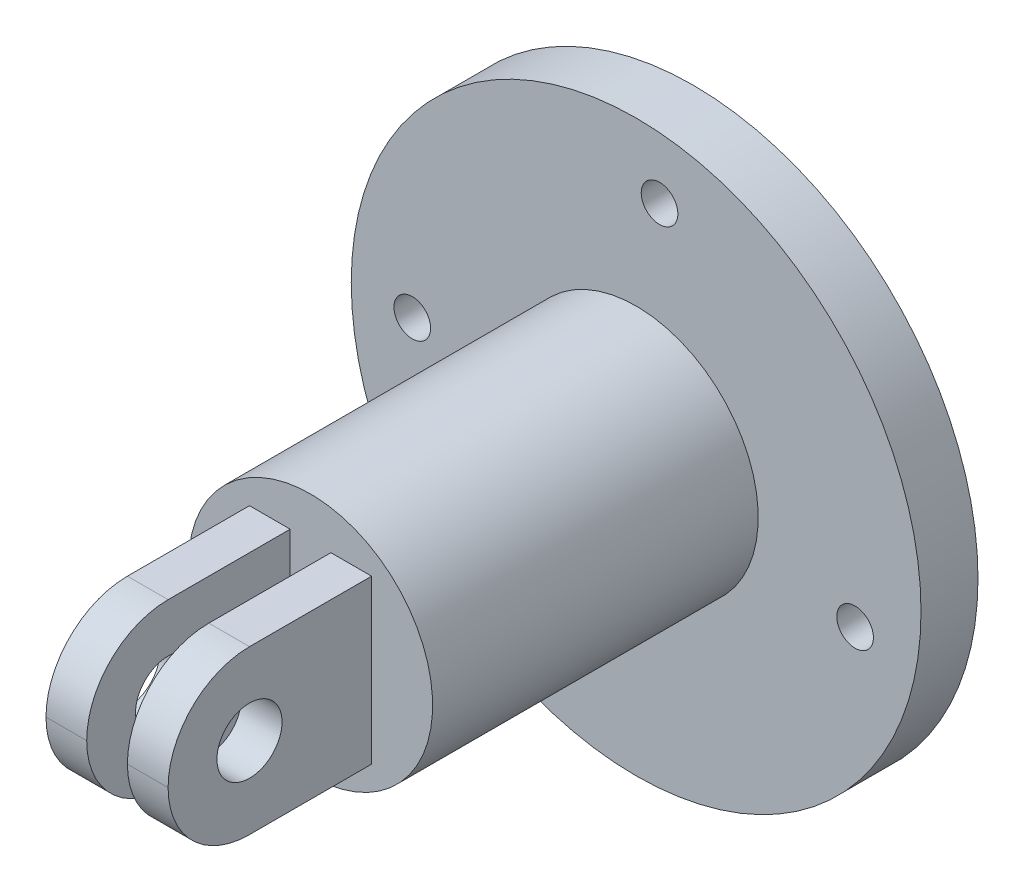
ISO-10303-21;
HEADER;
FILE_DESCRIPTION(('STEP AP214'),'2;1');
FILE_NAME('part.step','',(''),(''),'','','');
FILE_SCHEMA(('AUTOMOTIVE_DESIGN { 1 0 10303 214 1 1 1 1 }'));
ENDSEC;
DATA;
#1=APPLICATION_CONTEXT('core data for automotive mechanical design processes');
#2=APPLICATION_PROTOCOL_DEFINITION('international standard','automotive_design',2000,#1);
#3=PRODUCT_CONTEXT('',#1,'mechanical');
#4=PRODUCT('Part','Part','',(#3));
#5=PRODUCT_RELATED_PRODUCT_CATEGORY('part','',(#4));
#6=PRODUCT_DEFINITION_FORMATION('','',#4);
#7=PRODUCT_DEFINITION_CONTEXT('part definition',#1,'design');
#8=PRODUCT_DEFINITION('design','',#6,#7);
#9=PRODUCT_DEFINITION_SHAPE('','',#8);
#10=(LENGTH_UNIT() NAMED_UNIT(*) SI_UNIT(.MILLI.,.METRE.));
#11=(NAMED_UNIT(*) PLANE_ANGLE_UNIT() SI_UNIT($,.RADIAN.));
#12=(NAMED_UNIT(*) SI_UNIT($,.STERADIAN.) SOLID_ANGLE_UNIT());
#13=UNCERTAINTY_MEASURE_WITH_UNIT(LENGTH_MEASURE(1.E-05),#10,'distance_accuracy_value','');
#14=(GEOMETRIC_REPRESENTATION_CONTEXT(3) GLOBAL_UNCERTAINTY_ASSIGNED_CONTEXT((#13)) GLOBAL_UNIT_ASSIGNED_CONTEXT((#10,
#11,#12)) REPRESENTATION_CONTEXT('',''));
#15=CARTESIAN_POINT('',(0.,0.,0.));
#16=DIRECTION('',(0.,0.,1.));
#17=DIRECTION('',(1.,0.,0.));
#18=AXIS2_PLACEMENT_3D('',#15,#16,#17);
#19=CARTESIAN_POINT('',(0.,0.,0.));
#20=DIRECTION('',(0.,0.,-1.));
#21=DIRECTION('',(-1.,0.,0.));
#22=AXIS2_PLACEMENT_3D('',#19,#20,#21);
#23=PLANE('',#22);
#24=CARTESIAN_POINT('',(0.,0.,0.));
#25=DIRECTION('',(0.,0.,-1.));
#26=DIRECTION('',(-1.,0.,0.));
#27=AXIS2_PLACEMENT_3D('',#24,#25,#26);
#28=CIRCLE('',#27,15.);
#29=CARTESIAN_POINT('',(-15.,0.,0.));
#30=VERTEX_POINT('',#29);
#31=EDGE_CURVE('E144',#30,#30,#28,.T.);
#32=ORIENTED_EDGE('',*,*,#31,.F.);
#33=EDGE_LOOP('',(#32));
#34=FACE_BOUND('',#33,.T.);
#35=DIRECTION('',(0.,-1.,0.));
#36=VECTOR('',#35,1.);
#37=CARTESIAN_POINT('',(-7.5,10.,0.));
#38=LINE('',#37,#36);
#39=CARTESIAN_POINT('',(-7.5,10.,0.));
#40=VERTEX_POINT('',#39);
#41=CARTESIAN_POINT('',(-7.5,-10.,0.));
#42=VERTEX_POINT('',#41);
#43=EDGE_CURVE('E148',#40,#42,#38,.T.);
#44=ORIENTED_EDGE('',*,*,#43,.F.);
#45=DIRECTION('',(-1.,0.,0.));
#46=VECTOR('',#45,1.);
#47=CARTESIAN_POINT('',(-7.5,10.,0.));
#48=LINE('',#47,#46);
#49=CARTESIAN_POINT('',(-2.5,10.,0.));
#50=VERTEX_POINT('',#49);
#51=EDGE_CURVE('E159',#50,#40,#48,.T.);
#52=ORIENTED_EDGE('',*,*,#51,.F.);
#53=DIRECTION('',(0.,1.,0.));
#54=VECTOR('',#53,1.);
#55=CARTESIAN_POINT('',(-2.5,10.,0.));
#56=LINE('',#55,#54);
#57=CARTESIAN_POINT('',(-2.5,-10.,0.));
#58=VERTEX_POINT('',#57);
#59=EDGE_CURVE('E156',#58,#50,#56,.T.);
#60=ORIENTED_EDGE('',*,*,#59,.F.);
#61=DIRECTION('',(1.,0.,0.));
#62=VECTOR('',#61,1.);
#63=CARTESIAN_POINT('',(-7.5,-10.,0.));
#64=LINE('',#63,#62);
#65=EDGE_CURVE('E153',#42,#58,#64,.T.);
#66=ORIENTED_EDGE('',*,*,#65,.F.);
#67=EDGE_LOOP('',(#44,#52,#60,#66));
#68=FACE_BOUND('',#67,.T.);
#69=DIRECTION('',(0.,-1.,0.));
#70=VECTOR('',#69,1.);
#71=CARTESIAN_POINT('',(2.5,10.,0.));
#72=LINE('',#71,#70);
#73=CARTESIAN_POINT('',(2.5,10.,0.));
#74=VERTEX_POINT('',#73);
#75=CARTESIAN_POINT('',(2.5,-10.,0.));
#76=VERTEX_POINT('',#75);
#77=EDGE_CURVE('E114',#74,#76,#72,.T.);
#78=ORIENTED_EDGE('',*,*,#77,.F.);
#79=DIRECTION('',(-1.,0.,0.));
#80=VECTOR('',#79,1.);
#81=CARTESIAN_POINT('',(2.5,10.,0.));
#82=LINE('',#81,#80);
#83=CARTESIAN_POINT('',(7.5,10.,0.));
#84=VERTEX_POINT('',#83);
#85=EDGE_CURVE('E121',#84,#74,#82,.T.);
#86=ORIENTED_EDGE('',*,*,#85,.F.);
#87=DIRECTION('',(0.,1.,0.));
#88=VECTOR('',#87,1.);
#89=CARTESIAN_POINT('',(7.5,10.,0.));
#90=LINE('',#89,#88);
#91=CARTESIAN_POINT('',(7.5,-10.,0.));
#92=VERTEX_POINT('',#91);
#93=EDGE_CURVE('E134',#92,#84,#90,.T.);
#94=ORIENTED_EDGE('',*,*,#93,.F.);
#95=DIRECTION('',(1.,0.,0.));
#96=VECTOR('',#95,1.);
#97=CARTESIAN_POINT('',(2.5,-10.,0.));
#98=LINE('',#97,#96);
#99=EDGE_CURVE('E129',#76,#92,#98,.T.);
#100=ORIENTED_EDGE('',*,*,#99,.F.);
#101=EDGE_LOOP('',(#78,#86,#94,#100));
#102=FACE_BOUND('',#101,.T.);
#103=ADVANCED_FACE('F34',(#34,#68,#102),#23,.F.);
#104=CARTESIAN_POINT('',(-7.5,10.,25.));
#105=DIRECTION('',(1.,0.,0.));
#106=DIRECTION('',(0.,1.,0.));
#107=AXIS2_PLACEMENT_3D('',#104,#105,#106);
#108=PLANE('',#107);
#109=CARTESIAN_POINT('',(-7.5,0.,15.));
#110=DIRECTION('',(1.,0.,0.));
#111=DIRECTION('',(0.,1.,0.));
#112=AXIS2_PLACEMENT_3D('',#109,#110,#111);
#113=CIRCLE('',#112,4.);
#114=CARTESIAN_POINT('',(-7.5,4.,15.));
#115=VERTEX_POINT('',#114);
#116=EDGE_CURVE('E194',#115,#115,#113,.T.);
#117=ORIENTED_EDGE('',*,*,#116,.T.);
#118=EDGE_LOOP('',(#117));
#119=FACE_BOUND('',#118,.T.);
#120=DIRECTION('',(0.,0.,-1.));
#121=VECTOR('',#120,1.);
#122=CARTESIAN_POINT('',(-7.5,-10.,25.));
#123=LINE('',#122,#121);
#124=CARTESIAN_POINT('',(-7.5,-10.,15.));
#125=VERTEX_POINT('',#124);
#126=EDGE_CURVE('E168',#125,#42,#123,.T.);
#127=ORIENTED_EDGE('',*,*,#126,.F.);
#128=CARTESIAN_POINT('',(-7.5,0.,15.));
#129=DIRECTION('',(1.,0.,0.));
#130=DIRECTION('',(0.,1.,0.));
#131=AXIS2_PLACEMENT_3D('',#128,#129,#130);
#132=CIRCLE('',#131,10.);
#133=CARTESIAN_POINT('',(-7.5,0.,25.));
#134=VERTEX_POINT('',#133);
#135=EDGE_CURVE('E56',#125,#134,#132,.F.);
#136=ORIENTED_EDGE('',*,*,#135,.T.);
#137=CARTESIAN_POINT('',(-7.5,0.,15.));
#138=DIRECTION('',(1.,0.,0.));
#139=DIRECTION('',(0.,1.,0.));
#140=AXIS2_PLACEMENT_3D('',#137,#138,#139);
#141=CIRCLE('',#140,10.);
#142=CARTESIAN_POINT('',(-7.5,10.,15.));
#143=VERTEX_POINT('',#142);
#144=EDGE_CURVE('E51',#134,#143,#141,.F.);
#145=ORIENTED_EDGE('',*,*,#144,.T.);
#146=DIRECTION('',(0.,0.,-1.));
#147=VECTOR('',#146,1.);
#148=CARTESIAN_POINT('',(-7.5,10.,25.));
#149=LINE('',#148,#147);
#150=EDGE_CURVE('E162',#143,#40,#149,.T.);
#151=ORIENTED_EDGE('',*,*,#150,.T.);
#152=ORIENTED_EDGE('',*,*,#43,.T.);
#153=EDGE_LOOP('',(#127,#136,#145,#151,#152));
#154=FACE_BOUND('',#153,.T.);
#155=ADVANCED_FACE('F228',(#119,#154),#108,.F.);
#156=CARTESIAN_POINT('',(-7.5,-10.,25.));
#157=DIRECTION('',(0.,1.,0.));
#158=DIRECTION('',(0.,0.,1.));
#159=AXIS2_PLACEMENT_3D('',#156,#157,#158);
#160=PLANE('',#159);
#161=DIRECTION('',(0.,0.,-1.));
#162=VECTOR('',#161,1.);
#163=CARTESIAN_POINT('',(-2.5,-10.,25.));
#164=LINE('',#163,#162);
#165=CARTESIAN_POINT('',(-2.5,-10.,15.));
#166=VERTEX_POINT('',#165);
#167=EDGE_CURVE('E166',#166,#58,#164,.T.);
#168=ORIENTED_EDGE('',*,*,#167,.F.);
#169=DIRECTION('',(1.,0.,0.));
#170=VECTOR('',#169,1.);
#171=CARTESIAN_POINT('',(-7.5,-10.,15.));
#172=LINE('',#171,#170);
#173=EDGE_CURVE('E184',#166,#125,#172,.F.);
#174=ORIENTED_EDGE('',*,*,#173,.T.);
#175=ORIENTED_EDGE('',*,*,#126,.T.);
#176=ORIENTED_EDGE('',*,*,#65,.T.);
#177=EDGE_LOOP('',(#168,#174,#175,#176));
#178=FACE_BOUND('',#177,.T.);
#179=ADVANCED_FACE('F234',(#178),#160,.F.);
#180=CARTESIAN_POINT('',(-2.5,10.,25.));
#181=DIRECTION('',(-1.,0.,0.));
#182=DIRECTION('',(0.,-1.,0.));
#183=AXIS2_PLACEMENT_3D('',#180,#181,#182);
#184=PLANE('',#183);
#185=CARTESIAN_POINT('',(-2.5,0.,15.));
#186=DIRECTION('',(-1.,0.,0.));
#187=DIRECTION('',(0.,-1.,0.));
#188=AXIS2_PLACEMENT_3D('',#185,#186,#187);
#189=CIRCLE('',#188,4.);
#190=CARTESIAN_POINT('',(-2.5,-4.,15.));
#191=VERTEX_POINT('',#190);
#192=EDGE_CURVE('E199',#191,#191,#189,.T.);
#193=ORIENTED_EDGE('',*,*,#192,.T.);
#194=EDGE_LOOP('',(#193));
#195=FACE_BOUND('',#194,.T.);
#196=CARTESIAN_POINT('',(-2.5,0.,15.));
#197=DIRECTION('',(-1.,0.,0.));
#198=DIRECTION('',(0.,-1.,0.));
#199=AXIS2_PLACEMENT_3D('',#196,#197,#198);
#200=CIRCLE('',#199,10.);
#201=CARTESIAN_POINT('',(-2.5,10.,15.));
#202=VERTEX_POINT('',#201);
#203=CARTESIAN_POINT('',(-2.5,0.,25.));
#204=VERTEX_POINT('',#203);
#205=EDGE_CURVE('E180',#202,#204,#200,.F.);
#206=ORIENTED_EDGE('',*,*,#205,.T.);
#207=CARTESIAN_POINT('',(-2.5,0.,15.));
#208=DIRECTION('',(-1.,0.,0.));
#209=DIRECTION('',(0.,-1.,0.));
#210=AXIS2_PLACEMENT_3D('',#207,#208,#209);
#211=CIRCLE('',#210,10.);
#212=EDGE_CURVE('E182',#204,#166,#211,.F.);
#213=ORIENTED_EDGE('',*,*,#212,.T.);
#214=ORIENTED_EDGE('',*,*,#167,.T.);
#215=ORIENTED_EDGE('',*,*,#59,.T.);
#216=DIRECTION('',(0.,0.,-1.));
#217=VECTOR('',#216,1.);
#218=CARTESIAN_POINT('',(-2.5,10.,25.));
#219=LINE('',#218,#217);
#220=EDGE_CURVE('E164',#202,#50,#219,.T.);
#221=ORIENTED_EDGE('',*,*,#220,.F.);
#222=EDGE_LOOP('',(#206,#213,#214,#215,#221));
#223=FACE_BOUND('',#222,.T.);
#224=ADVANCED_FACE('F247',(#195,#223),#184,.F.);
#225=CARTESIAN_POINT('',(-7.5,10.,25.));
#226=DIRECTION('',(0.,-1.,0.));
#227=DIRECTION('',(0.,0.,-1.));
#228=AXIS2_PLACEMENT_3D('',#225,#226,#227);
#229=PLANE('',#228);
#230=ORIENTED_EDGE('',*,*,#150,.F.);
#231=DIRECTION('',(-1.,0.,0.));
#232=VECTOR('',#231,1.);
#233=CARTESIAN_POINT('',(-2.5,10.,15.));
#234=LINE('',#233,#232);
#235=EDGE_CURVE('E43',#143,#202,#234,.F.);
#236=ORIENTED_EDGE('',*,*,#235,.T.);
#237=ORIENTED_EDGE('',*,*,#220,.T.);
#238=ORIENTED_EDGE('',*,*,#51,.T.);
#239=EDGE_LOOP('',(#230,#236,#237,#238));
#240=FACE_BOUND('',#239,.T.);
#241=ADVANCED_FACE('F243',(#240),#229,.F.);
#242=CARTESIAN_POINT('',(0.,0.,-40.));
#243=DIRECTION('',(0.,0.,1.));
#244=DIRECTION('',(1.,0.,0.));
#245=AXIS2_PLACEMENT_3D('',#242,#243,#244);
#246=CYLINDRICAL_SURFACE('',#245,15.);
#247=CARTESIAN_POINT('',(0.,0.,-40.));
#248=DIRECTION('',(0.,0.,-1.));
#249=DIRECTION('',(-1.,0.,0.));
#250=AXIS2_PLACEMENT_3D('',#247,#248,#249);
#251=CIRCLE('',#250,15.);
#252=CARTESIAN_POINT('',(-15.,0.,-40.));
#253=VERTEX_POINT('',#252);
#254=EDGE_CURVE('E145',#253,#253,#251,.T.);
#255=ORIENTED_EDGE('',*,*,#254,.F.);
#256=EDGE_LOOP('',(#255));
#257=FACE_BOUND('',#256,.T.);
#258=ORIENTED_EDGE('',*,*,#31,.T.);
#259=EDGE_LOOP('',(#258));
#260=FACE_BOUND('',#259,.T.);
#261=ADVANCED_FACE('F240',(#257,#260),#246,.T.);
#262=CARTESIAN_POINT('',(2.5,10.,25.));
#263=DIRECTION('',(1.,0.,0.));
#264=DIRECTION('',(0.,1.,0.));
#265=AXIS2_PLACEMENT_3D('',#262,#263,#264);
#266=PLANE('',#265);
#267=CARTESIAN_POINT('',(2.5,0.,15.));
#268=DIRECTION('',(1.,0.,0.));
#269=DIRECTION('',(0.,1.,0.));
#270=AXIS2_PLACEMENT_3D('',#267,#268,#269);
#271=CIRCLE('',#270,4.);
#272=CARTESIAN_POINT('',(2.5,4.,15.));
#273=VERTEX_POINT('',#272);
#274=EDGE_CURVE('E204',#273,#273,#271,.T.);
#275=ORIENTED_EDGE('',*,*,#274,.T.);
#276=EDGE_LOOP('',(#275));
#277=FACE_BOUND('',#276,.T.);
#278=DIRECTION('',(0.,0.,-1.));
#279=VECTOR('',#278,1.);
#280=CARTESIAN_POINT('',(2.5,-10.,25.));
#281=LINE('',#280,#279);
#282=CARTESIAN_POINT('',(2.5,-10.,15.));
#283=VERTEX_POINT('',#282);
#284=EDGE_CURVE('E142',#283,#76,#281,.T.);
#285=ORIENTED_EDGE('',*,*,#284,.F.);
#286=CARTESIAN_POINT('',(2.5,0.,15.));
#287=DIRECTION('',(1.,0.,0.));
#288=DIRECTION('',(0.,1.,0.));
#289=AXIS2_PLACEMENT_3D('',#286,#287,#288);
#290=CIRCLE('',#289,10.);
#291=CARTESIAN_POINT('',(2.5,0.,25.));
#292=VERTEX_POINT('',#291);
#293=EDGE_CURVE('E178',#283,#292,#290,.F.);
#294=ORIENTED_EDGE('',*,*,#293,.T.);
#295=CARTESIAN_POINT('',(2.5,0.,15.));
#296=DIRECTION('',(1.,0.,0.));
#297=DIRECTION('',(0.,1.,0.));
#298=AXIS2_PLACEMENT_3D('',#295,#296,#297);
#299=CIRCLE('',#298,10.);
#300=CARTESIAN_POINT('',(2.5,10.,15.));
#301=VERTEX_POINT('',#300);
#302=EDGE_CURVE('E116',#292,#301,#299,.F.);
#303=ORIENTED_EDGE('',*,*,#302,.T.);
#304=DIRECTION('',(0.,0.,-1.));
#305=VECTOR('',#304,1.);
#306=CARTESIAN_POINT('',(2.5,10.,25.));
#307=LINE('',#306,#305);
#308=EDGE_CURVE('E110',#301,#74,#307,.T.);
#309=ORIENTED_EDGE('',*,*,#308,.T.);
#310=ORIENTED_EDGE('',*,*,#77,.T.);
#311=EDGE_LOOP('',(#285,#294,#303,#309,#310));
#312=FACE_BOUND('',#311,.T.);
#313=ADVANCED_FACE('F113',(#277,#312),#266,.F.);
#314=CARTESIAN_POINT('',(2.5,-10.,25.));
#315=DIRECTION('',(0.,1.,0.));
#316=DIRECTION('',(0.,0.,1.));
#317=AXIS2_PLACEMENT_3D('',#314,#315,#316);
#318=PLANE('',#317);
#319=DIRECTION('',(0.,0.,-1.));
#320=VECTOR('',#319,1.);
#321=CARTESIAN_POINT('',(7.5,-10.,25.));
#322=LINE('',#321,#320);
#323=CARTESIAN_POINT('',(7.5,-10.,15.));
#324=VERTEX_POINT('',#323);
#325=EDGE_CURVE('E140',#324,#92,#322,.T.);
#326=ORIENTED_EDGE('',*,*,#325,.F.);
#327=DIRECTION('',(1.,0.,0.));
#328=VECTOR('',#327,1.);
#329=CARTESIAN_POINT('',(2.5,-10.,15.));
#330=LINE('',#329,#328);
#331=EDGE_CURVE('E174',#324,#283,#330,.F.);
#332=ORIENTED_EDGE('',*,*,#331,.T.);
#333=ORIENTED_EDGE('',*,*,#284,.T.);
#334=ORIENTED_EDGE('',*,*,#99,.T.);
#335=EDGE_LOOP('',(#326,#332,#333,#334));
#336=FACE_BOUND('',#335,.T.);
#337=ADVANCED_FACE('F209',(#336),#318,.F.);
#338=CARTESIAN_POINT('',(7.5,10.,25.));
#339=DIRECTION('',(-1.,0.,0.));
#340=DIRECTION('',(0.,-1.,0.));
#341=AXIS2_PLACEMENT_3D('',#338,#339,#340);
#342=PLANE('',#341);
#343=CARTESIAN_POINT('',(7.5,0.,15.));
#344=DIRECTION('',(1.,0.,0.));
#345=DIRECTION('',(0.,1.,0.));
#346=AXIS2_PLACEMENT_3D('',#343,#344,#345);
#347=CIRCLE('',#346,4.);
#348=CARTESIAN_POINT('',(7.5,4.,15.));
#349=VERTEX_POINT('',#348);
#350=EDGE_CURVE('E297',#349,#349,#347,.T.);
#351=ORIENTED_EDGE('',*,*,#350,.F.);
#352=EDGE_LOOP('',(#351));
#353=FACE_BOUND('',#352,.T.);
#354=CARTESIAN_POINT('',(7.5,0.,15.));
#355=DIRECTION('',(-1.,0.,0.));
#356=DIRECTION('',(0.,-1.,0.));
#357=AXIS2_PLACEMENT_3D('',#354,#355,#356);
#358=CIRCLE('',#357,10.);
#359=CARTESIAN_POINT('',(7.5,10.,15.));
#360=VERTEX_POINT('',#359);
#361=CARTESIAN_POINT('',(7.5,0.,25.));
#362=VERTEX_POINT('',#361);
#363=EDGE_CURVE('E170',#360,#362,#358,.F.);
#364=ORIENTED_EDGE('',*,*,#363,.T.);
#365=CARTESIAN_POINT('',(7.5,0.,15.));
#366=DIRECTION('',(-1.,0.,0.));
#367=DIRECTION('',(0.,-1.,0.));
#368=AXIS2_PLACEMENT_3D('',#365,#366,#367);
#369=CIRCLE('',#368,10.);
#370=EDGE_CURVE('E172',#362,#324,#369,.F.);
#371=ORIENTED_EDGE('',*,*,#370,.T.);
#372=ORIENTED_EDGE('',*,*,#325,.T.);
#373=ORIENTED_EDGE('',*,*,#93,.T.);
#374=DIRECTION('',(0.,0.,-1.));
#375=VECTOR('',#374,1.);
#376=CARTESIAN_POINT('',(7.5,10.,25.));
#377=LINE('',#376,#375);
#378=EDGE_CURVE('E120',#360,#84,#377,.T.);
#379=ORIENTED_EDGE('',*,*,#378,.F.);
#380=EDGE_LOOP('',(#364,#371,#372,#373,#379));
#381=FACE_BOUND('',#380,.T.);
#382=ADVANCED_FACE('F215',(#353,#381),#342,.F.);
#383=CARTESIAN_POINT('',(2.5,10.,25.));
#384=DIRECTION('',(0.,-1.,0.));
#385=DIRECTION('',(1.,0.,0.));
#386=AXIS2_PLACEMENT_3D('',#383,#384,#385);
#387=PLANE('',#386);
#388=ORIENTED_EDGE('',*,*,#308,.F.);
#389=DIRECTION('',(-1.,0.,0.));
#390=VECTOR('',#389,1.);
#391=CARTESIAN_POINT('',(7.5,10.,15.));
#392=LINE('',#391,#390);
#393=EDGE_CURVE('E11',#301,#360,#392,.F.);
#394=ORIENTED_EDGE('',*,*,#393,.T.);
#395=ORIENTED_EDGE('',*,*,#378,.T.);
#396=ORIENTED_EDGE('',*,*,#85,.T.);
#397=EDGE_LOOP('',(#388,#394,#395,#396));
#398=FACE_BOUND('',#397,.T.);
#399=ADVANCED_FACE('F132',(#398),#387,.F.);
#400=CARTESIAN_POINT('',(0.,0.,15.));
#401=DIRECTION('',(1.,0.,0.));
#402=DIRECTION('',(0.,1.,0.));
#403=AXIS2_PLACEMENT_3D('',#400,#401,#402);
#404=CYLINDRICAL_SURFACE('',#403,10.);
#405=ORIENTED_EDGE('',*,*,#393,.F.);
#406=ORIENTED_EDGE('',*,*,#302,.F.);
#407=DIRECTION('',(-1.,0.,0.));
#408=VECTOR('',#407,1.);
#409=CARTESIAN_POINT('',(2.5,0.,25.));
#410=LINE('',#409,#408);
#411=EDGE_CURVE('E130',#362,#292,#410,.T.);
#412=ORIENTED_EDGE('',*,*,#411,.F.);
#413=ORIENTED_EDGE('',*,*,#363,.F.);
#414=EDGE_LOOP('',(#405,#406,#412,#413));
#415=FACE_BOUND('',#414,.T.);
#416=ADVANCED_FACE('F212',(#415),#404,.T.);
#417=CARTESIAN_POINT('',(0.,0.,15.));
#418=DIRECTION('',(-1.,0.,0.));
#419=DIRECTION('',(0.,0.,1.));
#420=AXIS2_PLACEMENT_3D('',#417,#418,#419);
#421=CYLINDRICAL_SURFACE('',#420,10.);
#422=ORIENTED_EDGE('',*,*,#293,.F.);
#423=ORIENTED_EDGE('',*,*,#331,.F.);
#424=ORIENTED_EDGE('',*,*,#370,.F.);
#425=ORIENTED_EDGE('',*,*,#411,.T.);
#426=EDGE_LOOP('',(#422,#423,#424,#425));
#427=FACE_BOUND('',#426,.T.);
#428=ADVANCED_FACE('F216',(#427),#421,.T.);
#429=CARTESIAN_POINT('',(0.,0.,15.));
#430=DIRECTION('',(1.,0.,0.));
#431=DIRECTION('',(0.,0.,-1.));
#432=AXIS2_PLACEMENT_3D('',#429,#430,#431);
#433=CYLINDRICAL_SURFACE('',#432,10.);
#434=ORIENTED_EDGE('',*,*,#235,.F.);
#435=ORIENTED_EDGE('',*,*,#144,.F.);
#436=DIRECTION('',(-1.,0.,0.));
#437=VECTOR('',#436,1.);
#438=CARTESIAN_POINT('',(-7.5,0.,25.));
#439=LINE('',#438,#437);
#440=EDGE_CURVE('E38',#204,#134,#439,.T.);
#441=ORIENTED_EDGE('',*,*,#440,.F.);
#442=ORIENTED_EDGE('',*,*,#205,.F.);
#443=EDGE_LOOP('',(#434,#435,#441,#442));
#444=FACE_BOUND('',#443,.T.);
#445=ADVANCED_FACE('F36',(#444),#433,.T.);
#446=CARTESIAN_POINT('',(0.,0.,15.));
#447=DIRECTION('',(-1.,0.,0.));
#448=DIRECTION('',(0.,0.,1.));
#449=AXIS2_PLACEMENT_3D('',#446,#447,#448);
#450=CYLINDRICAL_SURFACE('',#449,10.);
#451=ORIENTED_EDGE('',*,*,#135,.F.);
#452=ORIENTED_EDGE('',*,*,#173,.F.);
#453=ORIENTED_EDGE('',*,*,#212,.F.);
#454=ORIENTED_EDGE('',*,*,#440,.T.);
#455=EDGE_LOOP('',(#451,#452,#453,#454));
#456=FACE_BOUND('',#455,.T.);
#457=ADVANCED_FACE('F223',(#456),#450,.T.);
#458=CARTESIAN_POINT('',(-12.5,0.,15.));
#459=DIRECTION('',(1.,0.,0.));
#460=DIRECTION('',(0.,1.,0.));
#461=AXIS2_PLACEMENT_3D('',#458,#459,#460);
#462=CYLINDRICAL_SURFACE('',#461,4.);
#463=ORIENTED_EDGE('',*,*,#350,.T.);
#464=EDGE_LOOP('',(#463));
#465=FACE_BOUND('',#464,.T.);
#466=ORIENTED_EDGE('',*,*,#274,.F.);
#467=EDGE_LOOP('',(#466));
#468=FACE_BOUND('',#467,.T.);
#469=ADVANCED_FACE('F267',(#465,#468),#462,.F.);
#470=ORIENTED_EDGE('',*,*,#192,.F.);
#471=EDGE_LOOP('',(#470));
#472=FACE_BOUND('',#471,.T.);
#473=ORIENTED_EDGE('',*,*,#116,.F.);
#474=EDGE_LOOP('',(#473));
#475=FACE_BOUND('',#474,.T.);
#476=ADVANCED_FACE('F271',(#472,#475),#462,.F.);
#477=CARTESIAN_POINT('',(0.,0.,-47.));
#478=DIRECTION('',(0.,0.,1.));
#479=DIRECTION('',(1.,0.,0.));
#480=AXIS2_PLACEMENT_3D('',#477,#478,#479);
#481=CYLINDRICAL_SURFACE('',#480,35.);
#482=CARTESIAN_POINT('',(0.,0.,-47.));
#483=DIRECTION('',(0.,0.,-1.));
#484=DIRECTION('',(-1.,0.,0.));
#485=AXIS2_PLACEMENT_3D('',#482,#483,#484);
#486=CIRCLE('',#485,35.);
#487=CARTESIAN_POINT('',(-35.,0.,-47.));
#488=VERTEX_POINT('',#487);
#489=EDGE_CURVE('E298',#488,#488,#486,.T.);
#490=ORIENTED_EDGE('',*,*,#489,.F.);
#491=EDGE_LOOP('',(#490));
#492=FACE_BOUND('',#491,.T.);
#493=CARTESIAN_POINT('',(0.,0.,-40.));
#494=DIRECTION('',(0.,0.,-1.));
#495=DIRECTION('',(-1.,0.,0.));
#496=AXIS2_PLACEMENT_3D('',#493,#494,#495);
#497=CIRCLE('',#496,35.);
#498=CARTESIAN_POINT('',(-35.,0.,-40.));
#499=VERTEX_POINT('',#498);
#500=EDGE_CURVE('E301',#499,#499,#497,.T.);
#501=ORIENTED_EDGE('',*,*,#500,.T.);
#502=EDGE_LOOP('',(#501));
#503=FACE_BOUND('',#502,.T.);
#504=ADVANCED_FACE('F277',(#492,#503),#481,.T.);
#505=CARTESIAN_POINT('',(0.,0.,-47.));
#506=DIRECTION('',(0.,0.,-1.));
#507=DIRECTION('',(-1.,0.,0.));
#508=AXIS2_PLACEMENT_3D('',#505,#506,#507);
#509=PLANE('',#508);
#510=CARTESIAN_POINT('',(2.87453273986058,27.3493521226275,-47.));
#511=DIRECTION('',(0.,0.,1.));
#512=DIRECTION('',(-0.104528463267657,-0.994521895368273,0.));
#513=AXIS2_PLACEMENT_3D('',#510,#511,#512);
#514=CIRCLE('',#513,2.25);
#515=CARTESIAN_POINT('',(2.63934369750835,25.1116778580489,-47.));
#516=VERTEX_POINT('',#515);
#517=EDGE_CURVE('E310',#516,#516,#514,.T.);
#518=ORIENTED_EDGE('',*,*,#517,.T.);
#519=EDGE_LOOP('',(#518));
#520=FACE_BOUND('',#519,.T.);
#521=CARTESIAN_POINT('',(26.8990590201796,-5.71757149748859,-47.));
#522=DIRECTION('',(0.,0.,1.));
#523=DIRECTION('',(-0.978147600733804,0.207911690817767,0.));
#524=AXIS2_PLACEMENT_3D('',#521,#522,#523);
#525=CIRCLE('',#524,2.25);
#526=CARTESIAN_POINT('',(24.6982269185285,-5.24977019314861,-47.));
#527=VERTEX_POINT('',#526);
#528=EDGE_CURVE('E322',#527,#527,#525,.T.);
#529=ORIENTED_EDGE('',*,*,#528,.T.);
#530=EDGE_LOOP('',(#529));
#531=FACE_BOUND('',#530,.T.);
#532=CARTESIAN_POINT('',(-8.49796734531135,-26.1540541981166,-47.));
#533=DIRECTION('',(0.,0.,1.));
#534=DIRECTION('',(0.309016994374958,0.95105651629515,0.));
#535=AXIS2_PLACEMENT_3D('',#532,#533,#534);
#536=CIRCLE('',#535,2.25);
#537=CARTESIAN_POINT('',(-7.80267910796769,-24.0141770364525,-47.));
#538=VERTEX_POINT('',#537);
#539=EDGE_CURVE('E316',#538,#538,#536,.T.);
#540=ORIENTED_EDGE('',*,*,#539,.T.);
#541=EDGE_LOOP('',(#540));
#542=FACE_BOUND('',#541,.T.);
#543=CARTESIAN_POINT('',(-27.5,0.,-47.));
#544=DIRECTION('',(0.,0.,1.));
#545=DIRECTION('',(1.,0.,0.));
#546=AXIS2_PLACEMENT_3D('',#543,#544,#545);
#547=CIRCLE('',#546,2.25);
#548=CARTESIAN_POINT('',(-25.25,0.,-47.));
#549=VERTEX_POINT('',#548);
#550=EDGE_CURVE('E304',#549,#549,#547,.T.);
#551=ORIENTED_EDGE('',*,*,#550,.T.);
#552=EDGE_LOOP('',(#551));
#553=FACE_BOUND('',#552,.T.);
#554=ORIENTED_EDGE('',*,*,#489,.T.);
#555=EDGE_LOOP('',(#554));
#556=FACE_BOUND('',#555,.T.);
#557=ADVANCED_FACE('F331',(#520,#531,#542,#553,#556),#509,.T.);
#558=CARTESIAN_POINT('',(0.,0.,-40.));
#559=DIRECTION('',(0.,0.,-1.));
#560=DIRECTION('',(-1.,0.,0.));
#561=AXIS2_PLACEMENT_3D('',#558,#559,#560);
#562=PLANE('',#561);
#563=CARTESIAN_POINT('',(2.87453273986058,27.3493521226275,-40.));
#564=DIRECTION('',(0.,0.,1.));
#565=DIRECTION('',(-0.104528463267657,-0.994521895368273,0.));
#566=AXIS2_PLACEMENT_3D('',#563,#564,#565);
#567=CIRCLE('',#566,2.25);
#568=CARTESIAN_POINT('',(2.63934369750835,25.1116778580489,-40.));
#569=VERTEX_POINT('',#568);
#570=EDGE_CURVE('E325',#569,#569,#567,.T.);
#571=ORIENTED_EDGE('',*,*,#570,.F.);
#572=EDGE_LOOP('',(#571));
#573=FACE_BOUND('',#572,.T.);
#574=CARTESIAN_POINT('',(26.8990590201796,-5.71757149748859,-40.));
#575=DIRECTION('',(0.,0.,1.));
#576=DIRECTION('',(-0.978147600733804,0.207911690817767,0.));
#577=AXIS2_PLACEMENT_3D('',#574,#575,#576);
#578=CIRCLE('',#577,2.25);
#579=CARTESIAN_POINT('',(24.6982269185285,-5.24977019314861,-40.));
#580=VERTEX_POINT('',#579);
#581=EDGE_CURVE('E319',#580,#580,#578,.T.);
#582=ORIENTED_EDGE('',*,*,#581,.F.);
#583=EDGE_LOOP('',(#582));
#584=FACE_BOUND('',#583,.T.);
#585=CARTESIAN_POINT('',(-8.49796734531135,-26.1540541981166,-40.));
#586=DIRECTION('',(0.,0.,1.));
#587=DIRECTION('',(0.309016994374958,0.95105651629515,0.));
#588=AXIS2_PLACEMENT_3D('',#585,#586,#587);
#589=CIRCLE('',#588,2.25);
#590=CARTESIAN_POINT('',(-7.80267910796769,-24.0141770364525,-40.));
#591=VERTEX_POINT('',#590);
#592=EDGE_CURVE('E313',#591,#591,#589,.T.);
#593=ORIENTED_EDGE('',*,*,#592,.F.);
#594=EDGE_LOOP('',(#593));
#595=FACE_BOUND('',#594,.T.);
#596=CARTESIAN_POINT('',(-27.5,0.,-40.));
#597=DIRECTION('',(0.,0.,1.));
#598=DIRECTION('',(1.,0.,0.));
#599=AXIS2_PLACEMENT_3D('',#596,#597,#598);
#600=CIRCLE('',#599,2.25);
#601=CARTESIAN_POINT('',(-25.25,0.,-40.));
#602=VERTEX_POINT('',#601);
#603=EDGE_CURVE('E307',#602,#602,#600,.T.);
#604=ORIENTED_EDGE('',*,*,#603,.F.);
#605=EDGE_LOOP('',(#604));
#606=FACE_BOUND('',#605,.T.);
#607=ORIENTED_EDGE('',*,*,#254,.T.);
#608=EDGE_LOOP('',(#607));
#609=FACE_BOUND('',#608,.T.);
#610=ORIENTED_EDGE('',*,*,#500,.F.);
#611=EDGE_LOOP('',(#610));
#612=FACE_BOUND('',#611,.T.);
#613=ADVANCED_FACE('F341',(#573,#584,#595,#606,#609,#612),#562,.F.);
#614=CARTESIAN_POINT('',(-27.5,0.,-47.));
#615=DIRECTION('',(0.,0.,1.));
#616=DIRECTION('',(1.,0.,0.));
#617=AXIS2_PLACEMENT_3D('',#614,#615,#616);
#618=CYLINDRICAL_SURFACE('',#617,2.25);
#619=ORIENTED_EDGE('',*,*,#550,.F.);
#620=EDGE_LOOP('',(#619));
#621=FACE_BOUND('',#620,.T.);
#622=ORIENTED_EDGE('',*,*,#603,.T.);
#623=EDGE_LOOP('',(#622));
#624=FACE_BOUND('',#623,.T.);
#625=ADVANCED_FACE('F344',(#621,#624),#618,.F.);
#626=CARTESIAN_POINT('',(-8.49796734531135,-26.1540541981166,-47.));
#627=DIRECTION('',(0.,0.,1.));
#628=DIRECTION('',(1.,0.,0.));
#629=AXIS2_PLACEMENT_3D('',#626,#627,#628);
#630=CYLINDRICAL_SURFACE('',#629,2.25);
#631=ORIENTED_EDGE('',*,*,#539,.F.);
#632=EDGE_LOOP('',(#631));
#633=FACE_BOUND('',#632,.T.);
#634=ORIENTED_EDGE('',*,*,#592,.T.);
#635=EDGE_LOOP('',(#634));
#636=FACE_BOUND('',#635,.T.);
#637=ADVANCED_FACE('F368',(#633,#636),#630,.F.);
#638=CARTESIAN_POINT('',(26.8990590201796,-5.71757149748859,-47.));
#639=DIRECTION('',(0.,0.,1.));
#640=DIRECTION('',(1.,0.,0.));
#641=AXIS2_PLACEMENT_3D('',#638,#639,#640);
#642=CYLINDRICAL_SURFACE('',#641,2.25);
#643=ORIENTED_EDGE('',*,*,#528,.F.);
#644=EDGE_LOOP('',(#643));
#645=FACE_BOUND('',#644,.T.);
#646=ORIENTED_EDGE('',*,*,#581,.T.);
#647=EDGE_LOOP('',(#646));
#648=FACE_BOUND('',#647,.T.);
#649=ADVANCED_FACE('F337',(#645,#648),#642,.F.);
#650=CARTESIAN_POINT('',(2.87453273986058,27.3493521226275,-47.));
#651=DIRECTION('',(0.,0.,1.));
#652=DIRECTION('',(1.,0.,0.));
#653=AXIS2_PLACEMENT_3D('',#650,#651,#652);
#654=CYLINDRICAL_SURFACE('',#653,2.25);
#655=ORIENTED_EDGE('',*,*,#517,.F.);
#656=EDGE_LOOP('',(#655));
#657=FACE_BOUND('',#656,.T.);
#658=ORIENTED_EDGE('',*,*,#570,.T.);
#659=EDGE_LOOP('',(#658));
#660=FACE_BOUND('',#659,.T.);
#661=ADVANCED_FACE('F334',(#657,#660),#654,.F.);
#662=CLOSED_SHELL('',(#103,#155,#179,#224,#241,#261,#313,#337,#382,#399,#416,#428,#445,#457,
#469,#476,#504,#557,#613,#625,#637,#649,#661));
#663=MANIFOLD_SOLID_BREP('B2',#662);
#664=ADVANCED_BREP_SHAPE_REPRESENTATION('',(#18,#663),#14);
#665=SHAPE_DEFINITION_REPRESENTATION(#9,#664);
ENDSEC;
END-ISO-10303-21;
